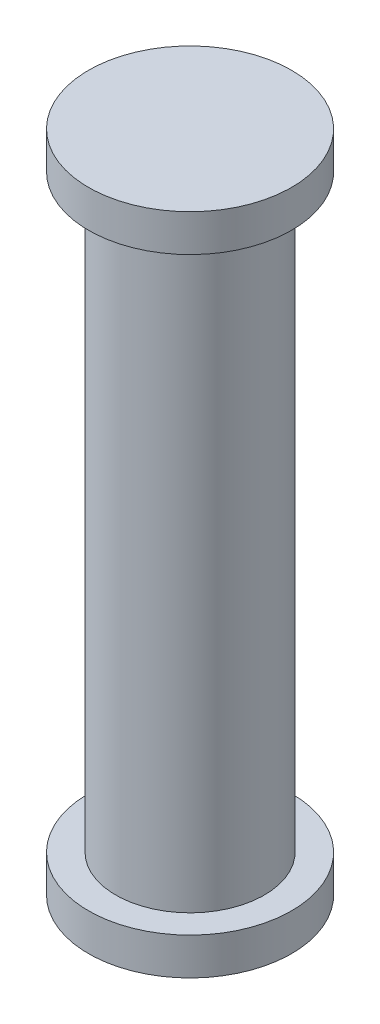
ISO-10303-21;
HEADER;
FILE_DESCRIPTION(('STEP AP214'),'2;1');
FILE_NAME('part.step','',(''),(''),'','','');
FILE_SCHEMA(('AUTOMOTIVE_DESIGN { 1 0 10303 214 1 1 1 1 }'));
ENDSEC;
DATA;
#1=APPLICATION_CONTEXT('core data for automotive mechanical design processes');
#2=APPLICATION_PROTOCOL_DEFINITION('international standard','automotive_design',2000,#1);
#3=PRODUCT_CONTEXT('',#1,'mechanical');
#4=PRODUCT('Part','Part','',(#3));
#5=PRODUCT_RELATED_PRODUCT_CATEGORY('part','',(#4));
#6=PRODUCT_DEFINITION_FORMATION('','',#4);
#7=PRODUCT_DEFINITION_CONTEXT('part definition',#1,'design');
#8=PRODUCT_DEFINITION('design','',#6,#7);
#9=PRODUCT_DEFINITION_SHAPE('','',#8);
#10=(LENGTH_UNIT() NAMED_UNIT(*) SI_UNIT(.MILLI.,.METRE.));
#11=(NAMED_UNIT(*) PLANE_ANGLE_UNIT() SI_UNIT($,.RADIAN.));
#12=(NAMED_UNIT(*) SI_UNIT($,.STERADIAN.) SOLID_ANGLE_UNIT());
#13=UNCERTAINTY_MEASURE_WITH_UNIT(LENGTH_MEASURE(1.E-05),#10,'distance_accuracy_value','');
#14=(GEOMETRIC_REPRESENTATION_CONTEXT(3) GLOBAL_UNCERTAINTY_ASSIGNED_CONTEXT((#13)) GLOBAL_UNIT_ASSIGNED_CONTEXT((#10,
#11,#12)) REPRESENTATION_CONTEXT('',''));
#15=CARTESIAN_POINT('',(0.,0.,0.));
#16=DIRECTION('',(0.,0.,1.));
#17=DIRECTION('',(1.,0.,0.));
#18=AXIS2_PLACEMENT_3D('',#15,#16,#17);
#19=CARTESIAN_POINT('',(0.,0.,0.));
#20=DIRECTION('',(0.,1.,0.));
#21=DIRECTION('',(0.,0.,1.));
#22=AXIS2_PLACEMENT_3D('',#19,#20,#21);
#23=PLANE('',#22);
#24=CARTESIAN_POINT('',(0.,0.,0.));
#25=DIRECTION('',(0.,-1.,0.));
#26=DIRECTION('',(0.,0.,-1.));
#27=AXIS2_PLACEMENT_3D('',#24,#25,#26);
#28=CIRCLE('',#27,4.1);
#29=CARTESIAN_POINT('',(0.,0.,-4.1));
#30=VERTEX_POINT('',#29);
#31=EDGE_CURVE('E10',#30,#30,#28,.T.);
#32=ORIENTED_EDGE('',*,*,#31,.F.);
#33=EDGE_LOOP('',(#32));
#34=FACE_BOUND('',#33,.T.);
#35=ADVANCED_FACE('F34',(#34),#23,.T.);
#36=CARTESIAN_POINT('',(0.,-26.8,0.));
#37=DIRECTION('',(0.,-1.,0.));
#38=DIRECTION('',(0.,0.,-1.));
#39=AXIS2_PLACEMENT_3D('',#36,#37,#38);
#40=CYLINDRICAL_SURFACE('',#39,4.1);
#41=ORIENTED_EDGE('',*,*,#31,.T.);
#42=EDGE_LOOP('',(#41));
#43=FACE_BOUND('',#42,.T.);
#44=CARTESIAN_POINT('',(0.,-1.5,0.));
#45=DIRECTION('',(0.,-1.,0.));
#46=DIRECTION('',(0.,0.,-1.));
#47=AXIS2_PLACEMENT_3D('',#44,#45,#46);
#48=CIRCLE('',#47,4.1);
#49=CARTESIAN_POINT('',(0.,-1.5,-4.1));
#50=VERTEX_POINT('',#49);
#51=EDGE_CURVE('E40',#50,#50,#48,.T.);
#52=ORIENTED_EDGE('',*,*,#51,.F.);
#53=EDGE_LOOP('',(#52));
#54=FACE_BOUND('',#53,.T.);
#55=ADVANCED_FACE('F76',(#43,#54),#40,.T.);
#56=CARTESIAN_POINT('',(0.,-1.5,-4.1));
#57=DIRECTION('',(0.,-1.,0.));
#58=DIRECTION('',(0.,0.,-1.));
#59=AXIS2_PLACEMENT_3D('',#56,#57,#58);
#60=PLANE('',#59);
#61=ORIENTED_EDGE('',*,*,#51,.T.);
#62=EDGE_LOOP('',(#61));
#63=FACE_BOUND('',#62,.T.);
#64=CARTESIAN_POINT('',(0.,-1.5,0.));
#65=DIRECTION('',(0.,-1.,0.));
#66=DIRECTION('',(0.,0.,-1.));
#67=AXIS2_PLACEMENT_3D('',#64,#65,#66);
#68=CIRCLE('',#67,3.);
#69=CARTESIAN_POINT('',(0.,-1.5,-3.));
#70=VERTEX_POINT('',#69);
#71=EDGE_CURVE('E44',#70,#70,#68,.T.);
#72=ORIENTED_EDGE('',*,*,#71,.F.);
#73=EDGE_LOOP('',(#72));
#74=FACE_BOUND('',#73,.T.);
#75=ADVANCED_FACE('F81',(#63,#74),#60,.T.);
#76=CARTESIAN_POINT('',(0.,-26.8,0.));
#77=DIRECTION('',(0.,-1.,0.));
#78=DIRECTION('',(0.,0.,-1.));
#79=AXIS2_PLACEMENT_3D('',#76,#77,#78);
#80=CYLINDRICAL_SURFACE('',#79,3.);
#81=ORIENTED_EDGE('',*,*,#71,.T.);
#82=EDGE_LOOP('',(#81));
#83=FACE_BOUND('',#82,.T.);
#84=CARTESIAN_POINT('',(0.,-25.3,0.));
#85=DIRECTION('',(0.,-1.,0.));
#86=DIRECTION('',(0.,0.,-1.));
#87=AXIS2_PLACEMENT_3D('',#84,#85,#86);
#88=CIRCLE('',#87,3.);
#89=CARTESIAN_POINT('',(0.,-25.3,-3.));
#90=VERTEX_POINT('',#89);
#91=EDGE_CURVE('E48',#90,#90,#88,.T.);
#92=ORIENTED_EDGE('',*,*,#91,.F.);
#93=EDGE_LOOP('',(#92));
#94=FACE_BOUND('',#93,.T.);
#95=ADVANCED_FACE('F72',(#83,#94),#80,.T.);
#96=CARTESIAN_POINT('',(0.,-25.3,-3.));
#97=DIRECTION('',(0.,1.,0.));
#98=DIRECTION('',(0.,0.,1.));
#99=AXIS2_PLACEMENT_3D('',#96,#97,#98);
#100=PLANE('',#99);
#101=ORIENTED_EDGE('',*,*,#91,.T.);
#102=EDGE_LOOP('',(#101));
#103=FACE_BOUND('',#102,.T.);
#104=CARTESIAN_POINT('',(0.,-25.3,0.));
#105=DIRECTION('',(0.,-1.,0.));
#106=DIRECTION('',(0.,0.,-1.));
#107=AXIS2_PLACEMENT_3D('',#104,#105,#106);
#108=CIRCLE('',#107,4.1);
#109=CARTESIAN_POINT('',(0.,-25.3,-4.1));
#110=VERTEX_POINT('',#109);
#111=EDGE_CURVE('E53',#110,#110,#108,.T.);
#112=ORIENTED_EDGE('',*,*,#111,.F.);
#113=EDGE_LOOP('',(#112));
#114=FACE_BOUND('',#113,.T.);
#115=ADVANCED_FACE('F64',(#103,#114),#100,.T.);
#116=CARTESIAN_POINT('',(0.,-26.8,0.));
#117=DIRECTION('',(0.,-1.,0.));
#118=DIRECTION('',(0.,0.,-1.));
#119=AXIS2_PLACEMENT_3D('',#116,#117,#118);
#120=CYLINDRICAL_SURFACE('',#119,4.1);
#121=ORIENTED_EDGE('',*,*,#111,.T.);
#122=EDGE_LOOP('',(#121));
#123=FACE_BOUND('',#122,.T.);
#124=CARTESIAN_POINT('',(0.,-26.8,0.));
#125=DIRECTION('',(0.,-1.,0.));
#126=DIRECTION('',(0.,0.,-1.));
#127=AXIS2_PLACEMENT_3D('',#124,#125,#126);
#128=CIRCLE('',#127,4.1);
#129=CARTESIAN_POINT('',(0.,-26.8,-4.1));
#130=VERTEX_POINT('',#129);
#131=EDGE_CURVE('E56',#130,#130,#128,.T.);
#132=ORIENTED_EDGE('',*,*,#131,.F.);
#133=EDGE_LOOP('',(#132));
#134=FACE_BOUND('',#133,.T.);
#135=ADVANCED_FACE('F62',(#123,#134),#120,.T.);
#136=CARTESIAN_POINT('',(0.,-26.8,-4.1));
#137=DIRECTION('',(0.,-1.,0.));
#138=DIRECTION('',(0.,0.,-1.));
#139=AXIS2_PLACEMENT_3D('',#136,#137,#138);
#140=PLANE('',#139);
#141=ORIENTED_EDGE('',*,*,#131,.T.);
#142=EDGE_LOOP('',(#141));
#143=FACE_BOUND('',#142,.T.);
#144=ADVANCED_FACE('F60',(#143),#140,.T.);
#145=CLOSED_SHELL('',(#35,#55,#75,#95,#115,#135,#144));
#146=MANIFOLD_SOLID_BREP('B2',#145);
#147=ADVANCED_BREP_SHAPE_REPRESENTATION('',(#18,#146),#14);
#148=SHAPE_DEFINITION_REPRESENTATION(#9,#147);
ENDSEC;
END-ISO-10303-21;
